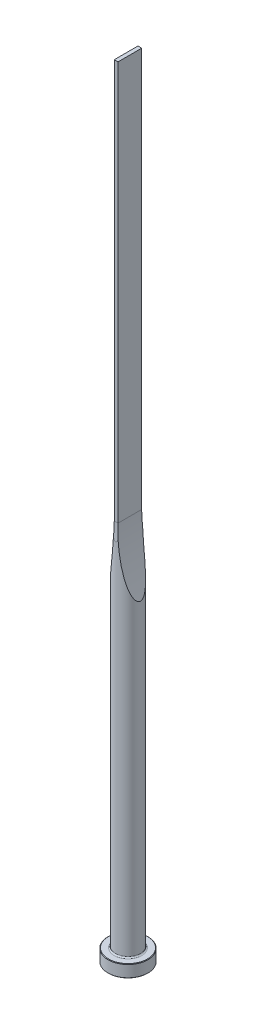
from build123d import *

# Parameters (mm, degrees)
CUT_EXTRUDE1_DEPTH = 5
CUT_EXTRUDE2_DEPTH = 5


with BuildPart() as part:
    # Sketch1 → Revolve1 (revolve)
    with BuildSketch(Plane.XY, mode=Mode.PRIVATE) as revolve1_sk:
        with BuildLine():
            Line((0, 0), (7.8, 0))
            Line((7.8, 0), (8, 0.2))
            Line((8, 0.2), (8, 4.8))
            Line((8, 4.8), (7.8, 5))
            Line((7.8, 5), (5.5, 5))
            ThreePointArc((5.5, 5), (5.146446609, 5.146446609), (5, 5.5))
            Line((5, 5.5), (5, 315))
            Line((5, 315), (0, 315))
            Line((0, 315), (0, 0))
        make_face()
    revolve(revolve1_sk.sketch.rotate(Axis((0, 315, 0), (0, -1, 0)), 180), axis=Axis((0, 315, 0), (0, -1, 0)))

    # Sketch2 → Cut-Extrude1 (cut, symmetric)
    with BuildSketch(Plane.XY):
        with BuildLine():
            Line((0.75, 315), (0.75, 155))
            ThreePointArc((0.75, 155), (1.818846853, 141.170683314), (5, 127.669842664))
            Line((5, 127.669842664), (5, 315))
            Line((5, 315), (0.75, 315))
        make_face()
        with BuildLine():
            Line((-0.75, 315), (-0.75, 155))
            ThreePointArc((-0.75, 155), (-1.818846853, 141.170683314), (-5, 127.669842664))
            Line((-5, 127.669842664), (-5, 315))
            Line((-5, 315), (-0.75, 315))
        make_face()
    extrude(amount=CUT_EXTRUDE1_DEPTH, both=True, mode=Mode.SUBTRACT)

    # Sketch3 → Cut-Extrude2 (cut, symmetric)
    with BuildSketch(Plane(origin=(0, 0, 0), x_dir=(0, 0, -1), z_dir=(1, 0, 0))):
        with BuildLine():
            Line((4.75, 315), (4.75, 155))
            ThreePointArc((4.75, 155), (4.812521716, 151.645898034), (5, 148.296456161))
            Line((5, 148.296456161), (5, 315))
            Line((5, 315), (4.75, 315))
        make_face()
        with BuildLine():
            Line((-4.75, 315), (-4.75, 155))
            ThreePointArc((-4.75, 155), (-4.812521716, 151.645898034), (-5, 148.296456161))
            Line((-5, 148.296456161), (-5, 315))
            Line((-5, 315), (-4.75, 315))
        make_face()
    extrude(amount=CUT_EXTRUDE2_DEPTH, both=True, mode=Mode.SUBTRACT)


solid = part.part
